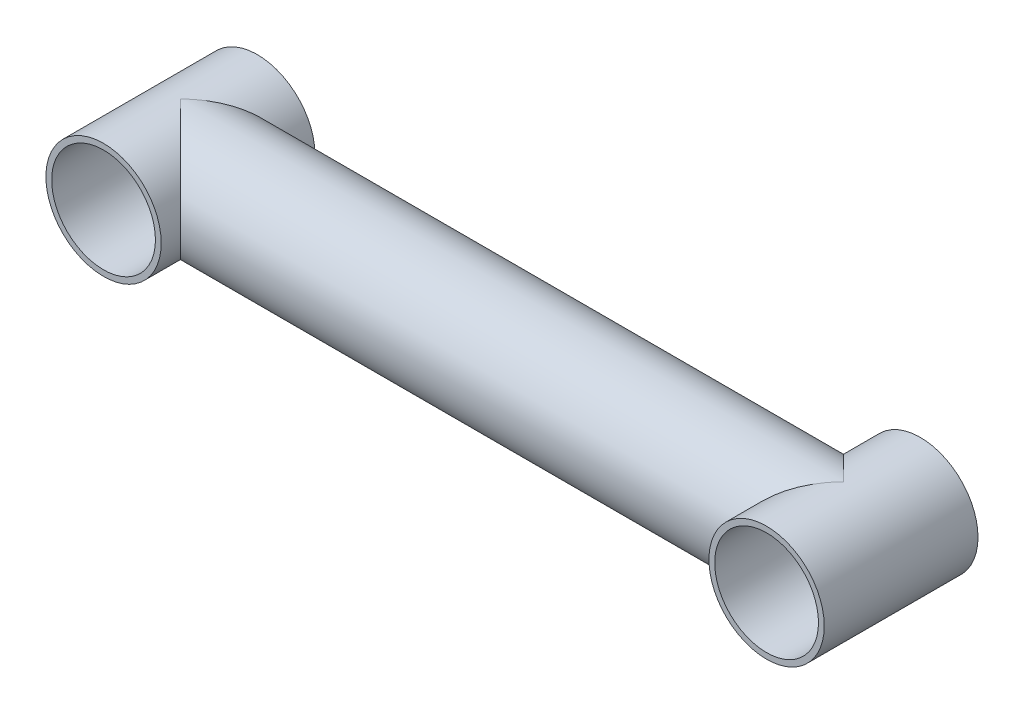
from build123d import *

# Parameters (mm, degrees)
ESQUISSE2_R             = 30
ESQUISSE2_R_2           = 27
BOSS_EXTRU_1_DEPTH      = 345
ESQUISSE3_R             = 30
BOSS_EXTRU_2_DEPTH      = 40
ESQUISSE4_R             = 27
ENL_V_MAT_EXTRU_1_DEPTH = 385.610192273


with BuildPart() as part:
    # Esquisse2 → Boss.-Extru.1 (new body)
    with BuildSketch(Plane(origin=(0, 0, 0), x_dir=(0, 0, -1), z_dir=(1, 0, 0))):
        Circle(ESQUISSE2_R)
        Circle(ESQUISSE2_R_2, mode=Mode.SUBTRACT)
    extrude(amount=-BOSS_EXTRU_1_DEPTH)

    # Esquisse3 → Boss.-Extru.2 (add, symmetric)
    with BuildSketch(Plane.XY):
        Circle(ESQUISSE3_R)
        with Locations((-345, 0)):
            Circle(ESQUISSE3_R)
    extrude(amount=BOSS_EXTRU_2_DEPTH, both=True)

    # Esquisse4 → Enl_v. mat.-Extru.1 (cut, through all)
    with BuildSketch(Plane.XY.offset(40)):
        with Locations((-345, 0)):
            Circle(ESQUISSE4_R)
        Circle(ESQUISSE4_R)
    extrude(amount=-ENL_V_MAT_EXTRU_1_DEPTH, mode=Mode.SUBTRACT)


solid = part.part
